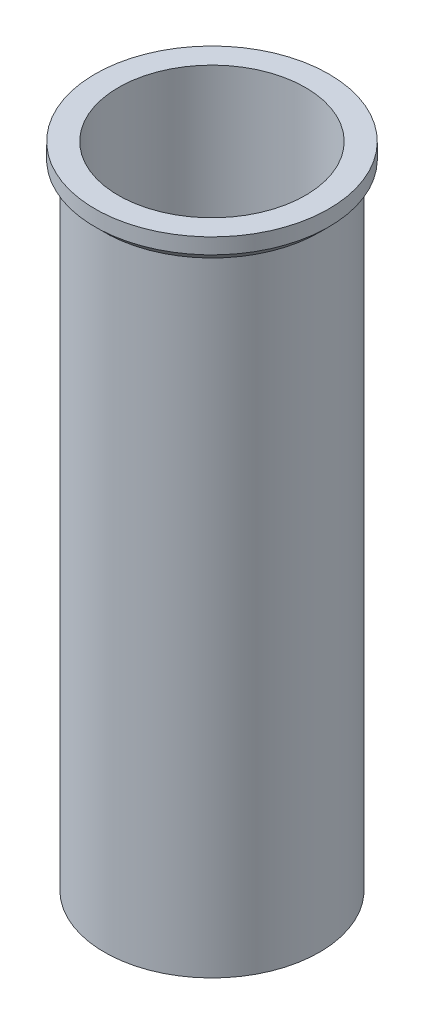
from build123d import *


with BuildPart() as part:
    # Esquisse1 → R_volution1 (revolve)
    with BuildSketch(Plane.XY, mode=Mode.PRIVATE) as r_volution1_sk:
        Polygon((0, 0), (-6.9, 0), (-6.9, 40), (-7.5, 40.6), (-7.5, 41.6), (-6, 41.6), (-6, 1), (0, 1), align=None)
    revolve(r_volution1_sk.sketch.rotate(Axis((0, 0, 0), (0, 1, 0)), 270), axis=Axis((0, 0, 0), (0, 1, 0)))


solid = part.part
